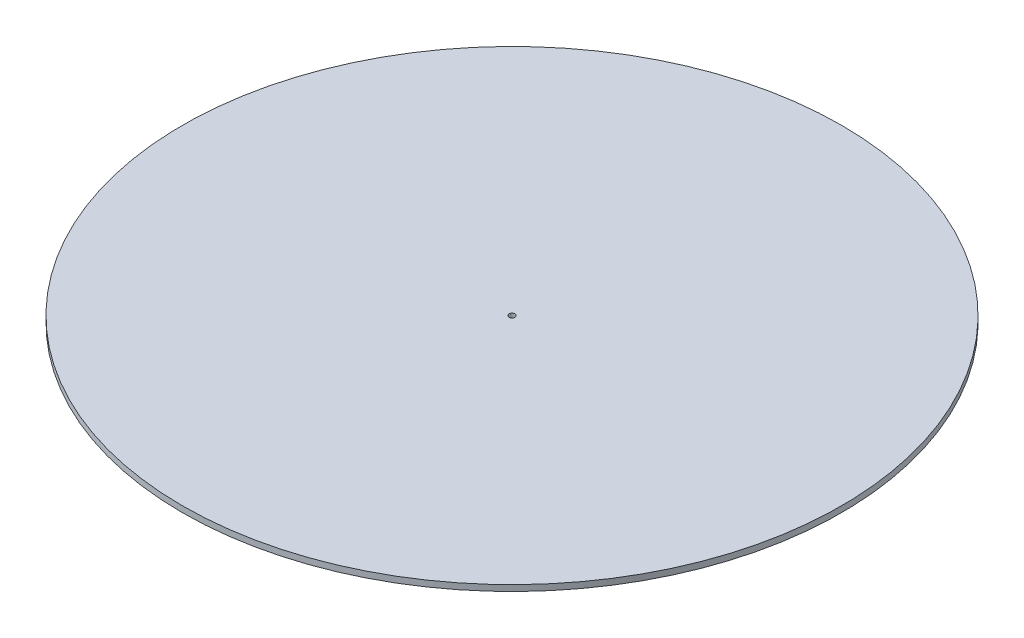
from build123d import *

# Parameters (mm, degrees)
SKETCH_1_R      = 550
SKETCH_1_R_2    = 5
EXTRUDE_1_DEPTH = 10


with BuildPart() as part:
    # Sketch 1 → Extrude 1 (new body)
    with BuildSketch(Plane(origin=(0, 0, 0), x_dir=(1, 0, 0), z_dir=(0, 1, 0))):
        with Locations(Location((0, 0, 0), (0, 0, 270))):
            Circle(SKETCH_1_R)
        with Locations(Location((0, 0, 0), (0, 0, 270))):
            Circle(SKETCH_1_R_2, mode=Mode.SUBTRACT)
    extrude(amount=EXTRUDE_1_DEPTH)


solid = part.part
